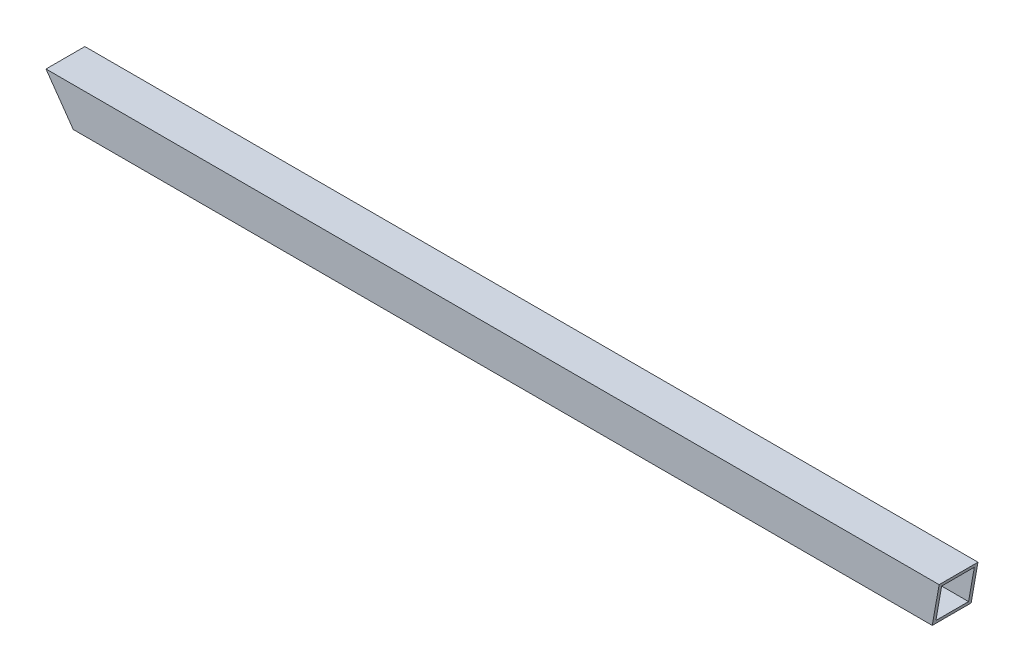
ISO-10303-21;
HEADER;
FILE_DESCRIPTION(('STEP AP214'),'2;1');
FILE_NAME('part.step','',(''),(''),'','','');
FILE_SCHEMA(('AUTOMOTIVE_DESIGN { 1 0 10303 214 1 1 1 1 }'));
ENDSEC;
DATA;
#1=APPLICATION_CONTEXT('core data for automotive mechanical design processes');
#2=APPLICATION_PROTOCOL_DEFINITION('international standard','automotive_design',2000,#1);
#3=PRODUCT_CONTEXT('',#1,'mechanical');
#4=PRODUCT('Part','Part','',(#3));
#5=PRODUCT_RELATED_PRODUCT_CATEGORY('part','',(#4));
#6=PRODUCT_DEFINITION_FORMATION('','',#4);
#7=PRODUCT_DEFINITION_CONTEXT('part definition',#1,'design');
#8=PRODUCT_DEFINITION('design','',#6,#7);
#9=PRODUCT_DEFINITION_SHAPE('','',#8);
#10=(LENGTH_UNIT() NAMED_UNIT(*) SI_UNIT(.MILLI.,.METRE.));
#11=(NAMED_UNIT(*) PLANE_ANGLE_UNIT() SI_UNIT($,.RADIAN.));
#12=(NAMED_UNIT(*) SI_UNIT($,.STERADIAN.) SOLID_ANGLE_UNIT());
#13=UNCERTAINTY_MEASURE_WITH_UNIT(LENGTH_MEASURE(1.E-05),#10,'distance_accuracy_value','');
#14=(GEOMETRIC_REPRESENTATION_CONTEXT(3) GLOBAL_UNCERTAINTY_ASSIGNED_CONTEXT((#13)) GLOBAL_UNIT_ASSIGNED_CONTEXT((#10,
#11,#12)) REPRESENTATION_CONTEXT('',''));
#15=CARTESIAN_POINT('',(0.,0.,0.));
#16=DIRECTION('',(0.,0.,1.));
#17=DIRECTION('',(1.,0.,0.));
#18=AXIS2_PLACEMENT_3D('',#15,#16,#17);
#19=CARTESIAN_POINT('',(17.5241026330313,-24.9480337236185,25.));
#20=DIRECTION('',(0.8182988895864,0.574792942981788,0.));
#21=DIRECTION('',(-0.574792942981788,0.8182988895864,0.));
#22=AXIS2_PLACEMENT_3D('',#19,#20,#21);
#23=PLANE('',#22);
#24=DIRECTION('',(0.,0.,1.));
#25=VECTOR('',#24,1.);
#26=CARTESIAN_POINT('',(1.38334433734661,-1.9693859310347,25.));
#27=LINE('',#26,#25);
#28=CARTESIAN_POINT('',(1.38334433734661,-1.9693859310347,2.));
#29=VERTEX_POINT('',#28);
#30=CARTESIAN_POINT('',(1.38334433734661,-1.9693859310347,23.));
#31=VERTEX_POINT('',#30);
#32=EDGE_CURVE('E156',#29,#31,#27,.T.);
#33=ORIENTED_EDGE('',*,*,#32,.T.);
#34=DIRECTION('',(0.574792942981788,-0.8182988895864,0.));
#35=VECTOR('',#34,1.);
#36=CARTESIAN_POINT('',(17.5241026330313,-24.9480337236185,23.));
#37=LINE('',#36,#35);
#38=CARTESIAN_POINT('',(16.1407582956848,-22.978647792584,23.));
#39=VERTEX_POINT('',#38);
#40=EDGE_CURVE('E159',#31,#39,#37,.T.);
#41=ORIENTED_EDGE('',*,*,#40,.T.);
#42=DIRECTION('',(0.,0.,-1.));
#43=VECTOR('',#42,1.);
#44=CARTESIAN_POINT('',(16.1407582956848,-22.978647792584,25.));
#45=LINE('',#44,#43);
#46=CARTESIAN_POINT('',(16.1407582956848,-22.978647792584,1.99999999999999));
#47=VERTEX_POINT('',#46);
#48=EDGE_CURVE('E151',#39,#47,#45,.T.);
#49=ORIENTED_EDGE('',*,*,#48,.T.);
#50=DIRECTION('',(-0.574792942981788,0.8182988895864,0.));
#51=VECTOR('',#50,1.);
#52=CARTESIAN_POINT('',(17.5241026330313,-24.9480337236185,1.99999999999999));
#53=LINE('',#52,#51);
#54=EDGE_CURVE('E131',#47,#29,#53,.T.);
#55=ORIENTED_EDGE('',*,*,#54,.T.);
#56=EDGE_LOOP('',(#33,#41,#49,#55));
#57=FACE_BOUND('',#56,.T.);
#58=DIRECTION('',(0.574792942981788,-0.8182988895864,0.));
#59=VECTOR('',#58,1.);
#60=CARTESIAN_POINT('',(17.5241026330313,-24.9480337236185,0.));
#61=LINE('',#60,#59);
#62=CARTESIAN_POINT('',(0.,0.,0.));
#63=VERTEX_POINT('',#62);
#64=CARTESIAN_POINT('',(17.5241026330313,-24.9480337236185,0.));
#65=VERTEX_POINT('',#64);
#66=EDGE_CURVE('E175',#63,#65,#61,.T.);
#67=ORIENTED_EDGE('',*,*,#66,.T.);
#68=DIRECTION('',(0.,0.,-1.));
#69=VECTOR('',#68,1.);
#70=CARTESIAN_POINT('',(17.5241026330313,-24.9480337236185,25.));
#71=LINE('',#70,#69);
#72=CARTESIAN_POINT('',(17.5241026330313,-24.9480337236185,25.));
#73=VERTEX_POINT('',#72);
#74=EDGE_CURVE('E12',#73,#65,#71,.T.);
#75=ORIENTED_EDGE('',*,*,#74,.F.);
#76=DIRECTION('',(0.574792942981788,-0.8182988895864,0.));
#77=VECTOR('',#76,1.);
#78=CARTESIAN_POINT('',(17.5241026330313,-24.9480337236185,25.));
#79=LINE('',#78,#77);
#80=CARTESIAN_POINT('',(0.,0.,25.));
#81=VERTEX_POINT('',#80);
#82=EDGE_CURVE('E176',#81,#73,#79,.T.);
#83=ORIENTED_EDGE('',*,*,#82,.F.);
#84=DIRECTION('',(0.,0.,-1.));
#85=VECTOR('',#84,1.);
#86=CARTESIAN_POINT('',(0.,0.,25.));
#87=LINE('',#86,#85);
#88=EDGE_CURVE('E184',#81,#63,#87,.T.);
#89=ORIENTED_EDGE('',*,*,#88,.T.);
#90=EDGE_LOOP('',(#67,#75,#83,#89));
#91=FACE_BOUND('',#90,.T.);
#92=ADVANCED_FACE('F59',(#57,#91),#23,.F.);
#93=CARTESIAN_POINT('',(570.,-24.9480337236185,25.));
#94=DIRECTION('',(0.,1.,0.));
#95=DIRECTION('',(-1.,0.,0.));
#96=AXIS2_PLACEMENT_3D('',#93,#94,#95);
#97=PLANE('',#96);
#98=DIRECTION('',(1.,0.,0.));
#99=VECTOR('',#98,1.);
#100=CARTESIAN_POINT('',(570.,-24.9480337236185,0.));
#101=LINE('',#100,#99);
#102=CARTESIAN_POINT('',(570.,-24.9480337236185,0.));
#103=VERTEX_POINT('',#102);
#104=EDGE_CURVE('E187',#65,#103,#101,.T.);
#105=ORIENTED_EDGE('',*,*,#104,.T.);
#106=DIRECTION('',(0.,0.,-1.));
#107=VECTOR('',#106,1.);
#108=CARTESIAN_POINT('',(570.,-24.9480337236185,25.));
#109=LINE('',#108,#107);
#110=CARTESIAN_POINT('',(570.,-24.9480337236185,25.));
#111=VERTEX_POINT('',#110);
#112=EDGE_CURVE('E67',#111,#103,#109,.T.);
#113=ORIENTED_EDGE('',*,*,#112,.F.);
#114=DIRECTION('',(1.,0.,0.));
#115=VECTOR('',#114,1.);
#116=CARTESIAN_POINT('',(570.,-24.9480337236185,25.));
#117=LINE('',#116,#115);
#118=EDGE_CURVE('E179',#73,#111,#117,.T.);
#119=ORIENTED_EDGE('',*,*,#118,.F.);
#120=ORIENTED_EDGE('',*,*,#74,.T.);
#121=EDGE_LOOP('',(#105,#113,#119,#120));
#122=FACE_BOUND('',#121,.T.);
#123=ADVANCED_FACE('F209',(#122),#97,.F.);
#124=CARTESIAN_POINT('',(0.,0.,25.));
#125=DIRECTION('',(0.,-1.,0.));
#126=DIRECTION('',(0.,0.,-1.));
#127=AXIS2_PLACEMENT_3D('',#124,#125,#126);
#128=PLANE('',#127);
#129=DIRECTION('',(-1.,0.,0.));
#130=VECTOR('',#129,1.);
#131=CARTESIAN_POINT('',(0.,0.,0.));
#132=LINE('',#131,#130);
#133=CARTESIAN_POINT('',(574.415985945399,0.,0.));
#134=VERTEX_POINT('',#133);
#135=EDGE_CURVE('E180',#134,#63,#132,.T.);
#136=ORIENTED_EDGE('',*,*,#135,.T.);
#137=ORIENTED_EDGE('',*,*,#88,.F.);
#138=DIRECTION('',(-1.,0.,0.));
#139=VECTOR('',#138,1.);
#140=CARTESIAN_POINT('',(0.,0.,25.));
#141=LINE('',#140,#139);
#142=CARTESIAN_POINT('',(574.415985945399,0.,25.));
#143=VERTEX_POINT('',#142);
#144=EDGE_CURVE('E182',#143,#81,#141,.T.);
#145=ORIENTED_EDGE('',*,*,#144,.F.);
#146=DIRECTION('',(0.,0.,1.));
#147=VECTOR('',#146,1.);
#148=CARTESIAN_POINT('',(574.415985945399,0.,0.));
#149=LINE('',#148,#147);
#150=EDGE_CURVE('E162',#134,#143,#149,.T.);
#151=ORIENTED_EDGE('',*,*,#150,.F.);
#152=EDGE_LOOP('',(#136,#137,#145,#151));
#153=FACE_BOUND('',#152,.T.);
#154=ADVANCED_FACE('F199',(#153),#128,.F.);
#155=CARTESIAN_POINT('',(0.,0.,25.));
#156=DIRECTION('',(0.,0.,-1.));
#157=DIRECTION('',(-1.,0.,0.));
#158=AXIS2_PLACEMENT_3D('',#155,#156,#157);
#159=PLANE('',#158);
#160=ORIENTED_EDGE('',*,*,#82,.T.);
#161=ORIENTED_EDGE('',*,*,#118,.T.);
#162=DIRECTION('',(0.174297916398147,0.984692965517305,0.));
#163=VECTOR('',#162,1.);
#164=CARTESIAN_POINT('',(570.,-24.9480337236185,25.));
#165=LINE('',#164,#163);
#166=EDGE_CURVE('E166',#111,#143,#165,.T.);
#167=ORIENTED_EDGE('',*,*,#166,.T.);
#168=ORIENTED_EDGE('',*,*,#144,.T.);
#169=EDGE_LOOP('',(#160,#161,#167,#168));
#170=FACE_BOUND('',#169,.T.);
#171=ADVANCED_FACE('F212',(#170),#159,.F.);
#172=CARTESIAN_POINT('',(0.,0.,0.));
#173=DIRECTION('',(0.,0.,-1.));
#174=DIRECTION('',(-1.,0.,0.));
#175=AXIS2_PLACEMENT_3D('',#172,#173,#174);
#176=PLANE('',#175);
#177=ORIENTED_EDGE('',*,*,#66,.F.);
#178=ORIENTED_EDGE('',*,*,#135,.F.);
#179=DIRECTION('',(0.174297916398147,0.984692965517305,0.));
#180=VECTOR('',#179,1.);
#181=CARTESIAN_POINT('',(570.,-24.9480337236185,0.));
#182=LINE('',#181,#180);
#183=EDGE_CURVE('E163',#103,#134,#182,.T.);
#184=ORIENTED_EDGE('',*,*,#183,.F.);
#185=ORIENTED_EDGE('',*,*,#104,.F.);
#186=EDGE_LOOP('',(#177,#178,#184,#185));
#187=FACE_BOUND('',#186,.T.);
#188=ADVANCED_FACE('F206',(#187),#176,.T.);
#189=CARTESIAN_POINT('',(570.,-24.9480337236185,0.));
#190=DIRECTION('',(0.984692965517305,-0.174297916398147,0.));
#191=DIRECTION('',(0.174297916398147,0.984692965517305,0.));
#192=AXIS2_PLACEMENT_3D('',#189,#190,#191);
#193=PLANE('',#192);
#194=DIRECTION('',(-0.174297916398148,-0.984692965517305,0.));
#195=VECTOR('',#194,1.);
#196=CARTESIAN_POINT('',(574.067390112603,-1.96938593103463,23.));
#197=LINE('',#196,#195);
#198=CARTESIAN_POINT('',(574.067390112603,-1.96938593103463,23.));
#199=VERTEX_POINT('',#198);
#200=CARTESIAN_POINT('',(570.348595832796,-22.9786477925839,23.));
#201=VERTEX_POINT('',#200);
#202=EDGE_CURVE('E83',#199,#201,#197,.T.);
#203=ORIENTED_EDGE('',*,*,#202,.F.);
#204=DIRECTION('',(0.,0.,1.));
#205=VECTOR('',#204,1.);
#206=CARTESIAN_POINT('',(574.067390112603,-1.96938593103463,23.));
#207=LINE('',#206,#205);
#208=CARTESIAN_POINT('',(574.067390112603,-1.96938593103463,2.));
#209=VERTEX_POINT('',#208);
#210=EDGE_CURVE('E144',#209,#199,#207,.T.);
#211=ORIENTED_EDGE('',*,*,#210,.F.);
#212=DIRECTION('',(0.174297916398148,0.984692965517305,0.));
#213=VECTOR('',#212,1.);
#214=CARTESIAN_POINT('',(574.067390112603,-1.96938593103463,2.));
#215=LINE('',#214,#213);
#216=CARTESIAN_POINT('',(570.348595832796,-22.9786477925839,1.99999999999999));
#217=VERTEX_POINT('',#216);
#218=EDGE_CURVE('E128',#217,#209,#215,.T.);
#219=ORIENTED_EDGE('',*,*,#218,.F.);
#220=DIRECTION('',(0.,0.,-1.));
#221=VECTOR('',#220,1.);
#222=CARTESIAN_POINT('',(570.348595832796,-22.9786477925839,23.));
#223=LINE('',#222,#221);
#224=EDGE_CURVE('E137',#201,#217,#223,.T.);
#225=ORIENTED_EDGE('',*,*,#224,.F.);
#226=EDGE_LOOP('',(#203,#211,#219,#225));
#227=FACE_BOUND('',#226,.T.);
#228=ORIENTED_EDGE('',*,*,#166,.F.);
#229=ORIENTED_EDGE('',*,*,#112,.T.);
#230=ORIENTED_EDGE('',*,*,#183,.T.);
#231=ORIENTED_EDGE('',*,*,#150,.T.);
#232=EDGE_LOOP('',(#228,#229,#230,#231));
#233=FACE_BOUND('',#232,.T.);
#234=ADVANCED_FACE('F141',(#227,#233),#193,.T.);
#235=CARTESIAN_POINT('',(-2.49999999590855E-05,-1.9693859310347,23.));
#236=DIRECTION('',(0.,0.,1.));
#237=DIRECTION('',(0.,-1.,0.));
#238=AXIS2_PLACEMENT_3D('',#235,#236,#237);
#239=PLANE('',#238);
#240=DIRECTION('',(1.,0.,0.));
#241=VECTOR('',#240,1.);
#242=CARTESIAN_POINT('',(-2.49999999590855E-05,-1.9693859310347,23.));
#243=LINE('',#242,#241);
#244=EDGE_CURVE('E149',#31,#199,#243,.T.);
#245=ORIENTED_EDGE('',*,*,#244,.T.);
#246=ORIENTED_EDGE('',*,*,#202,.T.);
#247=DIRECTION('',(1.,0.,0.));
#248=VECTOR('',#247,1.);
#249=CARTESIAN_POINT('',(-3.71881927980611,-22.978647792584,23.));
#250=LINE('',#249,#248);
#251=EDGE_CURVE('E134',#39,#201,#250,.T.);
#252=ORIENTED_EDGE('',*,*,#251,.F.);
#253=ORIENTED_EDGE('',*,*,#40,.F.);
#254=EDGE_LOOP('',(#245,#246,#252,#253));
#255=FACE_BOUND('',#254,.T.);
#256=ADVANCED_FACE('F214',(#255),#239,.F.);
#257=CARTESIAN_POINT('',(-2.49999999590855E-05,-1.9693859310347,23.));
#258=DIRECTION('',(0.,1.,0.));
#259=DIRECTION('',(-1.,0.,0.));
#260=AXIS2_PLACEMENT_3D('',#257,#258,#259);
#261=PLANE('',#260);
#262=DIRECTION('',(1.,0.,0.));
#263=VECTOR('',#262,1.);
#264=CARTESIAN_POINT('',(-2.49999999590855E-05,-1.9693859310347,2.));
#265=LINE('',#264,#263);
#266=EDGE_CURVE('E133',#29,#209,#265,.T.);
#267=ORIENTED_EDGE('',*,*,#266,.T.);
#268=ORIENTED_EDGE('',*,*,#210,.T.);
#269=ORIENTED_EDGE('',*,*,#244,.F.);
#270=ORIENTED_EDGE('',*,*,#32,.F.);
#271=EDGE_LOOP('',(#267,#268,#269,#270));
#272=FACE_BOUND('',#271,.T.);
#273=ADVANCED_FACE('F220',(#272),#261,.F.);
#274=CARTESIAN_POINT('',(-2.49999999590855E-05,-1.9693859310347,2.));
#275=DIRECTION('',(0.,0.,-1.));
#276=DIRECTION('',(0.,1.,0.));
#277=AXIS2_PLACEMENT_3D('',#274,#275,#276);
#278=PLANE('',#277);
#279=DIRECTION('',(1.,0.,0.));
#280=VECTOR('',#279,1.);
#281=CARTESIAN_POINT('',(-3.71881927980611,-22.978647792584,1.99999999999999));
#282=LINE('',#281,#280);
#283=EDGE_CURVE('E75',#47,#217,#282,.T.);
#284=ORIENTED_EDGE('',*,*,#283,.T.);
#285=ORIENTED_EDGE('',*,*,#218,.T.);
#286=ORIENTED_EDGE('',*,*,#266,.F.);
#287=ORIENTED_EDGE('',*,*,#54,.F.);
#288=EDGE_LOOP('',(#284,#285,#286,#287));
#289=FACE_BOUND('',#288,.T.);
#290=ADVANCED_FACE('F125',(#289),#278,.F.);
#291=CARTESIAN_POINT('',(-3.71881927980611,-22.978647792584,23.));
#292=DIRECTION('',(0.,-1.,0.));
#293=DIRECTION('',(1.,0.,0.));
#294=AXIS2_PLACEMENT_3D('',#291,#292,#293);
#295=PLANE('',#294);
#296=ORIENTED_EDGE('',*,*,#251,.T.);
#297=ORIENTED_EDGE('',*,*,#224,.T.);
#298=ORIENTED_EDGE('',*,*,#283,.F.);
#299=ORIENTED_EDGE('',*,*,#48,.F.);
#300=EDGE_LOOP('',(#296,#297,#298,#299));
#301=FACE_BOUND('',#300,.T.);
#302=ADVANCED_FACE('F138',(#301),#295,.F.);
#303=CLOSED_SHELL('',(#92,#123,#154,#171,#188,#234,#256,#273,#290,#302));
#304=MANIFOLD_SOLID_BREP('B2',#303);
#305=ADVANCED_BREP_SHAPE_REPRESENTATION('',(#18,#304),#14);
#306=SHAPE_DEFINITION_REPRESENTATION(#9,#305);
ENDSEC;
END-ISO-10303-21;
